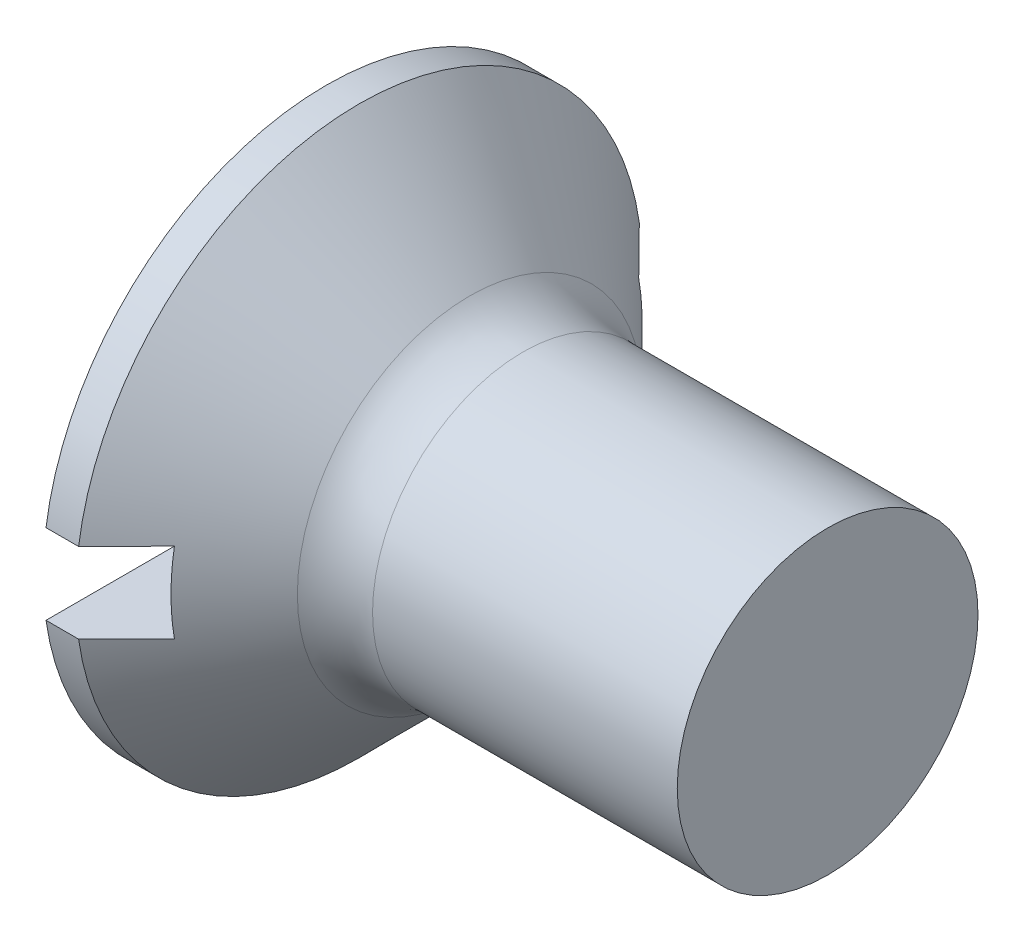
from build123d import *

# Parameters (mm, degrees)
FILLET1_R  = 1.5
SKETCH2_W  = 11.3
SKETCH2_H  = 1.6
SLOT_DEPTH = 1.6


with BuildPart() as part:
    # BodySke → Base-Revolve (revolve)
    with BuildSketch(Plane.XY, mode=Mode.PRIVATE) as base_revolve_sk:
        Polygon((0, 0), (0, 5.65), (0.65, 5.65), (3.3, 3), (10, 3), (10, 0), align=None)
    revolve(base_revolve_sk.sketch.rotate(Axis((-6.35, 0, 0), (1, 0, 0)), 90), axis=Axis((-6.35, 0, 0), (1, 0, 0)))

    # Fillet1
    fillet1_edges = [part.edges().sort_by_distance(p)[0] for p in [
        (3.3, 0, -3),
    ]]
    fillet(fillet1_edges, radius=FILLET1_R)

    # Sketch2 → Slot (cut)
    with BuildSketch(Plane.ZY):
        Rectangle(SKETCH2_W, SKETCH2_H)
    extrude(amount=-SLOT_DEPTH, mode=Mode.SUBTRACT)


solid = part.part
